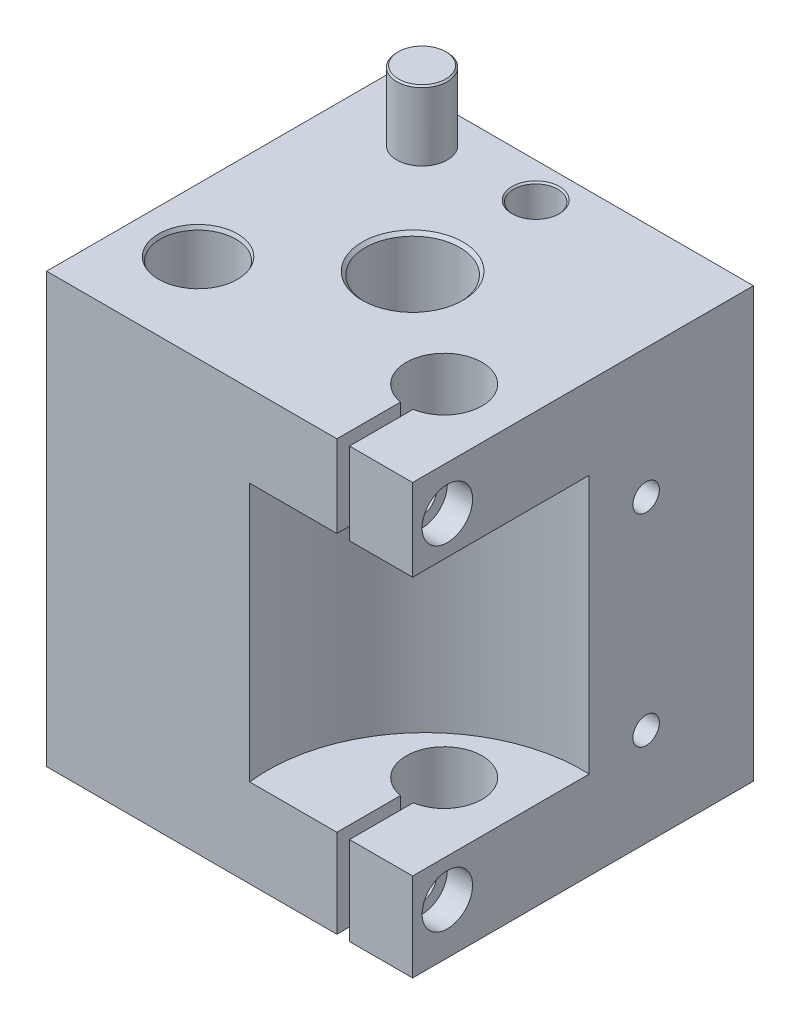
ISO-10303-21;
HEADER;
FILE_DESCRIPTION(('STEP AP214'),'2;1');
FILE_NAME('part.step','',(''),(''),'','','');
FILE_SCHEMA(('AUTOMOTIVE_DESIGN { 1 0 10303 214 1 1 1 1 }'));
ENDSEC;
DATA;
#1=APPLICATION_CONTEXT('core data for automotive mechanical design processes');
#2=APPLICATION_PROTOCOL_DEFINITION('international standard','automotive_design',2000,#1);
#3=PRODUCT_CONTEXT('',#1,'mechanical');
#4=PRODUCT('Part','Part','',(#3));
#5=PRODUCT_RELATED_PRODUCT_CATEGORY('part','',(#4));
#6=PRODUCT_DEFINITION_FORMATION('','',#4);
#7=PRODUCT_DEFINITION_CONTEXT('part definition',#1,'design');
#8=PRODUCT_DEFINITION('design','',#6,#7);
#9=PRODUCT_DEFINITION_SHAPE('','',#8);
#10=(LENGTH_UNIT() NAMED_UNIT(*) SI_UNIT(.MILLI.,.METRE.));
#11=(NAMED_UNIT(*) PLANE_ANGLE_UNIT() SI_UNIT($,.RADIAN.));
#12=(NAMED_UNIT(*) SI_UNIT($,.STERADIAN.) SOLID_ANGLE_UNIT());
#13=UNCERTAINTY_MEASURE_WITH_UNIT(LENGTH_MEASURE(1.E-05),#10,'distance_accuracy_value','');
#14=(GEOMETRIC_REPRESENTATION_CONTEXT(3) GLOBAL_UNCERTAINTY_ASSIGNED_CONTEXT((#13)) GLOBAL_UNIT_ASSIGNED_CONTEXT((#10,
#11,#12)) REPRESENTATION_CONTEXT('',''));
#15=CARTESIAN_POINT('',(0.,0.,0.));
#16=DIRECTION('',(0.,0.,1.));
#17=DIRECTION('',(1.,0.,0.));
#18=AXIS2_PLACEMENT_3D('',#15,#16,#17);
#19=CARTESIAN_POINT('',(58.,68.,0.));
#20=DIRECTION('',(-1.,0.,0.));
#21=DIRECTION('',(0.,0.,1.));
#22=AXIS2_PLACEMENT_3D('',#19,#20,#21);
#23=PLANE('',#22);
#24=CARTESIAN_POINT('',(58.,61.,-5.5));
#25=DIRECTION('',(1.,0.,0.));
#26=DIRECTION('',(0.,0.,-1.));
#27=AXIS2_PLACEMENT_3D('',#24,#25,#26);
#28=CIRCLE('',#27,4.);
#29=CARTESIAN_POINT('',(58.,61.,-9.5));
#30=VERTEX_POINT('',#29);
#31=EDGE_CURVE('E9358',#30,#30,#28,.T.);
#32=ORIENTED_EDGE('',*,*,#31,.F.);
#33=EDGE_LOOP('',(#32));
#34=FACE_BOUND('',#33,.T.);
#35=CARTESIAN_POINT('',(58.,15.5,-37.));
#36=DIRECTION('',(1.,0.,0.));
#37=DIRECTION('',(0.,0.,-1.));
#38=AXIS2_PLACEMENT_3D('',#35,#36,#37);
#39=CIRCLE('',#38,2.09999999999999);
#40=CARTESIAN_POINT('',(58.,15.5,-39.1));
#41=VERTEX_POINT('',#40);
#42=EDGE_CURVE('E9367',#41,#41,#39,.T.);
#43=ORIENTED_EDGE('',*,*,#42,.F.);
#44=EDGE_LOOP('',(#43));
#45=FACE_BOUND('',#44,.T.);
#46=CARTESIAN_POINT('',(58.,47.5,-37.));
#47=DIRECTION('',(1.,0.,0.));
#48=DIRECTION('',(0.,0.,-1.));
#49=AXIS2_PLACEMENT_3D('',#46,#47,#48);
#50=CIRCLE('',#49,2.1);
#51=CARTESIAN_POINT('',(58.,47.5,-39.1));
#52=VERTEX_POINT('',#51);
#53=EDGE_CURVE('E9373',#52,#52,#50,.T.);
#54=ORIENTED_EDGE('',*,*,#53,.F.);
#55=EDGE_LOOP('',(#54));
#56=FACE_BOUND('',#55,.T.);
#57=DIRECTION('',(0.,0.,1.));
#58=VECTOR('',#57,1.);
#59=CARTESIAN_POINT('',(58.,55.,0.));
#60=LINE('',#59,#58);
#61=CARTESIAN_POINT('',(58.,55.,-27.9799919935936));
#62=VERTEX_POINT('',#61);
#63=CARTESIAN_POINT('',(58.,55.,0.));
#64=VERTEX_POINT('',#63);
#65=EDGE_CURVE('E9455',#62,#64,#60,.T.);
#66=ORIENTED_EDGE('',*,*,#65,.F.);
#67=DIRECTION('',(0.,-1.,0.));
#68=VECTOR('',#67,1.);
#69=CARTESIAN_POINT('',(58.,55.,-27.9799919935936));
#70=LINE('',#69,#68);
#71=CARTESIAN_POINT('',(58.,14.,-27.9799919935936));
#72=VERTEX_POINT('',#71);
#73=EDGE_CURVE('E11',#62,#72,#70,.T.);
#74=ORIENTED_EDGE('',*,*,#73,.T.);
#75=DIRECTION('',(0.,0.,1.));
#76=VECTOR('',#75,1.);
#77=CARTESIAN_POINT('',(58.,14.,0.));
#78=LINE('',#77,#76);
#79=CARTESIAN_POINT('',(58.,14.,0.));
#80=VERTEX_POINT('',#79);
#81=EDGE_CURVE('E9443',#72,#80,#78,.T.);
#82=ORIENTED_EDGE('',*,*,#81,.T.);
#83=DIRECTION('',(0.,-1.,0.));
#84=VECTOR('',#83,1.);
#85=CARTESIAN_POINT('',(58.,68.,0.));
#86=LINE('',#85,#84);
#87=CARTESIAN_POINT('',(58.,0.,0.));
#88=VERTEX_POINT('',#87);
#89=EDGE_CURVE('E9550',#80,#88,#86,.T.);
#90=ORIENTED_EDGE('',*,*,#89,.T.);
#91=DIRECTION('',(0.,0.,-1.));
#92=VECTOR('',#91,1.);
#93=CARTESIAN_POINT('',(58.,0.,0.));
#94=LINE('',#93,#92);
#95=CARTESIAN_POINT('',(58.,0.,-54.));
#96=VERTEX_POINT('',#95);
#97=EDGE_CURVE('E9529',#88,#96,#94,.T.);
#98=ORIENTED_EDGE('',*,*,#97,.T.);
#99=DIRECTION('',(0.,-1.,0.));
#100=VECTOR('',#99,1.);
#101=CARTESIAN_POINT('',(58.,68.,-54.));
#102=LINE('',#101,#100);
#103=CARTESIAN_POINT('',(58.,68.,-54.));
#104=VERTEX_POINT('',#103);
#105=EDGE_CURVE('E9547',#104,#96,#102,.T.);
#106=ORIENTED_EDGE('',*,*,#105,.F.);
#107=DIRECTION('',(0.,0.,-1.));
#108=VECTOR('',#107,1.);
#109=CARTESIAN_POINT('',(58.,68.,0.));
#110=LINE('',#109,#108);
#111=CARTESIAN_POINT('',(58.,68.,0.));
#112=VERTEX_POINT('',#111);
#113=EDGE_CURVE('E9540',#112,#104,#110,.T.);
#114=ORIENTED_EDGE('',*,*,#113,.F.);
#115=EDGE_CURVE('E9551',#112,#64,#86,.T.);
#116=ORIENTED_EDGE('',*,*,#115,.T.);
#117=EDGE_LOOP('',(#66,#74,#82,#90,#98,#106,#114,#116));
#118=FACE_BOUND('',#117,.T.);
#119=CARTESIAN_POINT('',(58.,8.,-5.5));
#120=DIRECTION('',(1.,0.,0.));
#121=DIRECTION('',(0.,0.,-1.));
#122=AXIS2_PLACEMENT_3D('',#119,#120,#121);
#123=CIRCLE('',#122,3.99999999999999);
#124=CARTESIAN_POINT('',(58.,8.,-9.49999999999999));
#125=VERTEX_POINT('',#124);
#126=EDGE_CURVE('E9346',#125,#125,#123,.T.);
#127=ORIENTED_EDGE('',*,*,#126,.F.);
#128=EDGE_LOOP('',(#127));
#129=FACE_BOUND('',#128,.T.);
#130=ADVANCED_FACE('F9177',(#34,#45,#56,#118,#129),#23,.F.);
#131=CARTESIAN_POINT('',(0.,68.,0.));
#132=DIRECTION('',(0.,0.,-1.));
#133=DIRECTION('',(-1.,0.,0.));
#134=AXIS2_PLACEMENT_3D('',#131,#132,#133);
#135=PLANE('',#134);
#136=DIRECTION('',(-1.,0.,0.));
#137=VECTOR('',#136,1.);
#138=CARTESIAN_POINT('',(0.,55.,0.));
#139=LINE('',#138,#137);
#140=CARTESIAN_POINT('',(48.,55.,0.));
#141=VERTEX_POINT('',#140);
#142=EDGE_CURVE('E9451',#64,#141,#139,.T.);
#143=ORIENTED_EDGE('',*,*,#142,.F.);
#144=ORIENTED_EDGE('',*,*,#115,.F.);
#145=DIRECTION('',(1.,0.,0.));
#146=VECTOR('',#145,1.);
#147=CARTESIAN_POINT('',(0.,68.,0.));
#148=LINE('',#147,#146);
#149=CARTESIAN_POINT('',(48.,68.,0.));
#150=VERTEX_POINT('',#149);
#151=EDGE_CURVE('E9536',#150,#112,#148,.T.);
#152=ORIENTED_EDGE('',*,*,#151,.F.);
#153=DIRECTION('',(0.,1.,0.));
#154=VECTOR('',#153,1.);
#155=CARTESIAN_POINT('',(48.,70.,0.));
#156=LINE('',#155,#154);
#157=EDGE_CURVE('E9462',#141,#150,#156,.T.);
#158=ORIENTED_EDGE('',*,*,#157,.F.);
#159=EDGE_LOOP('',(#143,#144,#152,#158));
#160=FACE_BOUND('',#159,.T.);
#161=ADVANCED_FACE('F9605',(#160),#135,.F.);
#162=DIRECTION('',(-1.,0.,0.));
#163=VECTOR('',#162,1.);
#164=CARTESIAN_POINT('',(0.,55.,0.));
#165=LINE('',#164,#163);
#166=CARTESIAN_POINT('',(46.,55.,0.));
#167=VERTEX_POINT('',#166);
#168=CARTESIAN_POINT('',(32.1806527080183,55.,0.));
#169=VERTEX_POINT('',#168);
#170=EDGE_CURVE('E9457',#167,#169,#165,.T.);
#171=ORIENTED_EDGE('',*,*,#170,.F.);
#172=DIRECTION('',(0.,-1.,0.));
#173=VECTOR('',#172,1.);
#174=CARTESIAN_POINT('',(46.,70.,0.));
#175=LINE('',#174,#173);
#176=CARTESIAN_POINT('',(46.,68.,0.));
#177=VERTEX_POINT('',#176);
#178=EDGE_CURVE('E9467',#177,#167,#175,.T.);
#179=ORIENTED_EDGE('',*,*,#178,.F.);
#180=CARTESIAN_POINT('',(0.,68.,0.));
#181=VERTEX_POINT('',#180);
#182=EDGE_CURVE('E9537',#181,#177,#148,.T.);
#183=ORIENTED_EDGE('',*,*,#182,.F.);
#184=DIRECTION('',(0.,-1.,0.));
#185=VECTOR('',#184,1.);
#186=CARTESIAN_POINT('',(0.,68.,0.));
#187=LINE('',#186,#185);
#188=CARTESIAN_POINT('',(0.,0.,0.));
#189=VERTEX_POINT('',#188);
#190=EDGE_CURVE('E9554',#181,#189,#187,.T.);
#191=ORIENTED_EDGE('',*,*,#190,.T.);
#192=DIRECTION('',(1.,0.,0.));
#193=VECTOR('',#192,1.);
#194=CARTESIAN_POINT('',(0.,0.,0.));
#195=LINE('',#194,#193);
#196=CARTESIAN_POINT('',(46.,0.,0.));
#197=VERTEX_POINT('',#196);
#198=EDGE_CURVE('E9526',#189,#197,#195,.T.);
#199=ORIENTED_EDGE('',*,*,#198,.T.);
#200=CARTESIAN_POINT('',(46.,14.,0.));
#201=VERTEX_POINT('',#200);
#202=EDGE_CURVE('E9466',#201,#197,#175,.T.);
#203=ORIENTED_EDGE('',*,*,#202,.F.);
#204=DIRECTION('',(-1.,0.,0.));
#205=VECTOR('',#204,1.);
#206=CARTESIAN_POINT('',(0.,14.,0.));
#207=LINE('',#206,#205);
#208=CARTESIAN_POINT('',(32.1806527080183,14.,0.));
#209=VERTEX_POINT('',#208);
#210=EDGE_CURVE('E9446',#201,#209,#207,.T.);
#211=ORIENTED_EDGE('',*,*,#210,.T.);
#212=DIRECTION('',(0.,-1.,0.));
#213=VECTOR('',#212,1.);
#214=CARTESIAN_POINT('',(32.1806527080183,55.,0.));
#215=LINE('',#214,#213);
#216=EDGE_CURVE('E9459',#209,#169,#215,.F.);
#217=ORIENTED_EDGE('',*,*,#216,.T.);
#218=EDGE_LOOP('',(#171,#179,#183,#191,#199,#203,#211,#217));
#219=FACE_BOUND('',#218,.T.);
#220=ADVANCED_FACE('F9593',(#219),#135,.F.);
#221=CARTESIAN_POINT('',(47.,68.,-16.));
#222=DIRECTION('',(0.,1.,0.));
#223=DIRECTION('',(0.,0.,1.));
#224=AXIS2_PLACEMENT_3D('',#221,#222,#223);
#225=CYLINDRICAL_SURFACE('',#224,5.99999999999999);
#226=CARTESIAN_POINT('',(47.,55.,-16.));
#227=DIRECTION('',(0.,-1.,0.));
#228=DIRECTION('',(0.,0.,-1.));
#229=AXIS2_PLACEMENT_3D('',#226,#227,#228);
#230=CIRCLE('',#229,5.99999999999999);
#231=CARTESIAN_POINT('',(48.,55.,-10.0839202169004));
#232=VERTEX_POINT('',#231);
#233=CARTESIAN_POINT('',(46.,55.,-10.0839202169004));
#234=VERTEX_POINT('',#233);
#235=EDGE_CURVE('E9449',#232,#234,#230,.F.);
#236=ORIENTED_EDGE('',*,*,#235,.F.);
#237=DIRECTION('',(0.,1.,0.));
#238=VECTOR('',#237,1.);
#239=CARTESIAN_POINT('',(48.,68.,-10.0839202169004));
#240=LINE('',#239,#238);
#241=CARTESIAN_POINT('',(48.,68.,-10.0839202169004));
#242=VERTEX_POINT('',#241);
#243=EDGE_CURVE('E9200',#232,#242,#240,.T.);
#244=ORIENTED_EDGE('',*,*,#243,.T.);
#245=CARTESIAN_POINT('',(47.,68.,-16.));
#246=DIRECTION('',(0.,1.,0.));
#247=DIRECTION('',(0.,0.,1.));
#248=AXIS2_PLACEMENT_3D('',#245,#246,#247);
#249=CIRCLE('',#248,5.99999999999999);
#250=CARTESIAN_POINT('',(46.,68.,-10.0839202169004));
#251=VERTEX_POINT('',#250);
#252=EDGE_CURVE('E9484',#242,#251,#249,.T.);
#253=ORIENTED_EDGE('',*,*,#252,.T.);
#254=DIRECTION('',(0.,1.,0.));
#255=VECTOR('',#254,1.);
#256=CARTESIAN_POINT('',(46.,68.,-10.0839202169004));
#257=LINE('',#256,#255);
#258=EDGE_CURVE('E9567',#251,#234,#257,.F.);
#259=ORIENTED_EDGE('',*,*,#258,.T.);
#260=EDGE_LOOP('',(#236,#244,#253,#259));
#261=FACE_BOUND('',#260,.T.);
#262=ADVANCED_FACE('F9581',(#261),#225,.F.);
#263=CARTESIAN_POINT('',(46.,70.,-16.));
#264=DIRECTION('',(-1.,0.,0.));
#265=DIRECTION('',(0.,-1.,0.));
#266=AXIS2_PLACEMENT_3D('',#263,#264,#265);
#267=PLANE('',#266);
#268=CARTESIAN_POINT('',(46.,61.,-5.5));
#269=DIRECTION('',(1.,0.,0.));
#270=DIRECTION('',(0.,0.,-1.));
#271=AXIS2_PLACEMENT_3D('',#268,#269,#270);
#272=CIRCLE('',#271,1.64999999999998);
#273=CARTESIAN_POINT('',(46.,61.,-7.14999999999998));
#274=VERTEX_POINT('',#273);
#275=EDGE_CURVE('E9332',#274,#274,#272,.T.);
#276=ORIENTED_EDGE('',*,*,#275,.F.);
#277=EDGE_LOOP('',(#276));
#278=FACE_BOUND('',#277,.T.);
#279=DIRECTION('',(0.,0.,1.));
#280=VECTOR('',#279,1.);
#281=CARTESIAN_POINT('',(46.,55.,-16.));
#282=LINE('',#281,#280);
#283=EDGE_CURVE('E9453',#234,#167,#282,.T.);
#284=ORIENTED_EDGE('',*,*,#283,.F.);
#285=ORIENTED_EDGE('',*,*,#258,.F.);
#286=DIRECTION('',(0.,0.,-1.));
#287=VECTOR('',#286,1.);
#288=CARTESIAN_POINT('',(46.,68.,-54.));
#289=LINE('',#288,#287);
#290=EDGE_CURVE('E9470',#177,#251,#289,.T.);
#291=ORIENTED_EDGE('',*,*,#290,.F.);
#292=ORIENTED_EDGE('',*,*,#178,.T.);
#293=EDGE_LOOP('',(#284,#285,#291,#292));
#294=FACE_BOUND('',#293,.T.);
#295=ADVANCED_FACE('F9590',(#278,#294),#267,.F.);
#296=CARTESIAN_POINT('',(48.,70.,-16.));
#297=DIRECTION('',(1.,0.,0.));
#298=DIRECTION('',(0.,1.,0.));
#299=AXIS2_PLACEMENT_3D('',#296,#297,#298);
#300=PLANE('',#299);
#301=CARTESIAN_POINT('',(48.,61.,-5.5));
#302=DIRECTION('',(1.,0.,0.));
#303=DIRECTION('',(0.,1.,0.));
#304=AXIS2_PLACEMENT_3D('',#301,#302,#303);
#305=CIRCLE('',#304,2.25);
#306=CARTESIAN_POINT('',(48.,63.25,-5.5));
#307=VERTEX_POINT('',#306);
#308=EDGE_CURVE('E9361',#307,#307,#305,.T.);
#309=ORIENTED_EDGE('',*,*,#308,.T.);
#310=EDGE_LOOP('',(#309));
#311=FACE_BOUND('',#310,.T.);
#312=DIRECTION('',(0.,0.,-1.));
#313=VECTOR('',#312,1.);
#314=CARTESIAN_POINT('',(48.,55.,-16.));
#315=LINE('',#314,#313);
#316=EDGE_CURVE('E9185',#141,#232,#315,.T.);
#317=ORIENTED_EDGE('',*,*,#316,.F.);
#318=ORIENTED_EDGE('',*,*,#157,.T.);
#319=DIRECTION('',(0.,0.,1.));
#320=VECTOR('',#319,1.);
#321=CARTESIAN_POINT('',(48.,68.,-54.));
#322=LINE('',#321,#320);
#323=EDGE_CURVE('E9476',#242,#150,#322,.T.);
#324=ORIENTED_EDGE('',*,*,#323,.F.);
#325=ORIENTED_EDGE('',*,*,#243,.F.);
#326=EDGE_LOOP('',(#317,#318,#324,#325));
#327=FACE_BOUND('',#326,.T.);
#328=ADVANCED_FACE('F9582',(#311,#327),#300,.F.);
#329=ORIENTED_EDGE('',*,*,#89,.F.);
#330=DIRECTION('',(-1.,0.,0.));
#331=VECTOR('',#330,1.);
#332=CARTESIAN_POINT('',(0.,14.,0.));
#333=LINE('',#332,#331);
#334=CARTESIAN_POINT('',(48.,14.,0.));
#335=VERTEX_POINT('',#334);
#336=EDGE_CURVE('E9437',#80,#335,#333,.T.);
#337=ORIENTED_EDGE('',*,*,#336,.T.);
#338=CARTESIAN_POINT('',(48.,0.,0.));
#339=VERTEX_POINT('',#338);
#340=EDGE_CURVE('E9463',#339,#335,#156,.T.);
#341=ORIENTED_EDGE('',*,*,#340,.F.);
#342=EDGE_CURVE('E9525',#339,#88,#195,.T.);
#343=ORIENTED_EDGE('',*,*,#342,.T.);
#344=EDGE_LOOP('',(#329,#337,#341,#343));
#345=FACE_BOUND('',#344,.T.);
#346=ADVANCED_FACE('F9636',(#345),#135,.F.);
#347=CARTESIAN_POINT('',(0.,0.,-54.));
#348=DIRECTION('',(0.,-1.,0.));
#349=DIRECTION('',(0.,0.,-1.));
#350=AXIS2_PLACEMENT_3D('',#347,#348,#349);
#351=PLANE('',#350);
#352=DIRECTION('',(0.,0.,1.));
#353=VECTOR('',#352,1.);
#354=CARTESIAN_POINT('',(48.,0.,-54.));
#355=LINE('',#354,#353);
#356=CARTESIAN_POINT('',(48.,0.,-10.0839202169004));
#357=VERTEX_POINT('',#356);
#358=EDGE_CURVE('E9479',#357,#339,#355,.T.);
#359=ORIENTED_EDGE('',*,*,#358,.F.);
#360=CARTESIAN_POINT('',(47.,0.,-16.));
#361=DIRECTION('',(0.,1.,0.));
#362=DIRECTION('',(0.,0.,1.));
#363=AXIS2_PLACEMENT_3D('',#360,#361,#362);
#364=CIRCLE('',#363,5.99999999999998);
#365=CARTESIAN_POINT('',(46.,0.,-10.0839202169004));
#366=VERTEX_POINT('',#365);
#367=EDGE_CURVE('E9481',#357,#366,#364,.T.);
#368=ORIENTED_EDGE('',*,*,#367,.T.);
#369=DIRECTION('',(0.,0.,-1.));
#370=VECTOR('',#369,1.);
#371=CARTESIAN_POINT('',(46.,0.,-54.));
#372=LINE('',#371,#370);
#373=EDGE_CURVE('E9473',#197,#366,#372,.T.);
#374=ORIENTED_EDGE('',*,*,#373,.F.);
#375=ORIENTED_EDGE('',*,*,#198,.F.);
#376=DIRECTION('',(0.,0.,1.));
#377=VECTOR('',#376,1.);
#378=CARTESIAN_POINT('',(0.,0.,0.));
#379=LINE('',#378,#377);
#380=CARTESIAN_POINT('',(0.,0.,-54.));
#381=VERTEX_POINT('',#380);
#382=EDGE_CURVE('E9522',#381,#189,#379,.T.);
#383=ORIENTED_EDGE('',*,*,#382,.F.);
#384=DIRECTION('',(-1.,0.,0.));
#385=VECTOR('',#384,1.);
#386=CARTESIAN_POINT('',(0.,0.,-54.));
#387=LINE('',#386,#385);
#388=EDGE_CURVE('E9531',#96,#381,#387,.T.);
#389=ORIENTED_EDGE('',*,*,#388,.F.);
#390=ORIENTED_EDGE('',*,*,#97,.F.);
#391=ORIENTED_EDGE('',*,*,#342,.F.);
#392=EDGE_LOOP('',(#359,#368,#374,#375,#383,#389,#390,#391));
#393=FACE_BOUND('',#392,.T.);
#394=CARTESIAN_POINT('',(29.,0.,-48.5));
#395=DIRECTION('',(0.,1.,0.));
#396=DIRECTION('',(0.,0.,1.));
#397=AXIS2_PLACEMENT_3D('',#394,#395,#396);
#398=CIRCLE('',#397,3.74999999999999);
#399=CARTESIAN_POINT('',(29.,0.,-44.75));
#400=VERTEX_POINT('',#399);
#401=EDGE_CURVE('E9486',#400,#400,#398,.T.);
#402=ORIENTED_EDGE('',*,*,#401,.T.);
#403=EDGE_LOOP('',(#402));
#404=FACE_BOUND('',#403,.T.);
#405=CARTESIAN_POINT('',(29.,0.,-29.));
#406=DIRECTION('',(0.,1.,0.));
#407=DIRECTION('',(0.,0.,1.));
#408=AXIS2_PLACEMENT_3D('',#405,#406,#407);
#409=CIRCLE('',#408,7.99999999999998);
#410=CARTESIAN_POINT('',(29.,0.,-21.));
#411=VERTEX_POINT('',#410);
#412=EDGE_CURVE('E9510',#411,#411,#409,.T.);
#413=ORIENTED_EDGE('',*,*,#412,.T.);
#414=EDGE_LOOP('',(#413));
#415=FACE_BOUND('',#414,.T.);
#416=CARTESIAN_POINT('',(10.,0.,-14.));
#417=DIRECTION('',(0.,1.,0.));
#418=DIRECTION('',(0.,0.,1.));
#419=AXIS2_PLACEMENT_3D('',#416,#417,#418);
#420=CIRCLE('',#419,6.24999999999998);
#421=CARTESIAN_POINT('',(10.,0.,-7.75000000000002));
#422=VERTEX_POINT('',#421);
#423=EDGE_CURVE('E9498',#422,#422,#420,.T.);
#424=ORIENTED_EDGE('',*,*,#423,.T.);
#425=EDGE_LOOP('',(#424));
#426=FACE_BOUND('',#425,.T.);
#427=ADVANCED_FACE('F9621',(#393,#404,#415,#426),#351,.T.);
#428=CARTESIAN_POINT('',(0.,68.,-54.));
#429=DIRECTION('',(0.,-1.,0.));
#430=DIRECTION('',(0.,0.,-1.));
#431=AXIS2_PLACEMENT_3D('',#428,#429,#430);
#432=PLANE('',#431);
#433=ORIENTED_EDGE('',*,*,#252,.F.);
#434=ORIENTED_EDGE('',*,*,#323,.T.);
#435=ORIENTED_EDGE('',*,*,#151,.T.);
#436=ORIENTED_EDGE('',*,*,#113,.T.);
#437=DIRECTION('',(-1.,0.,0.));
#438=VECTOR('',#437,1.);
#439=CARTESIAN_POINT('',(0.,68.,-54.));
#440=LINE('',#439,#438);
#441=CARTESIAN_POINT('',(0.,68.,-54.));
#442=VERTEX_POINT('',#441);
#443=EDGE_CURVE('E9542',#104,#442,#440,.T.);
#444=ORIENTED_EDGE('',*,*,#443,.T.);
#445=DIRECTION('',(0.,0.,1.));
#446=VECTOR('',#445,1.);
#447=CARTESIAN_POINT('',(0.,68.,0.));
#448=LINE('',#447,#446);
#449=EDGE_CURVE('E9533',#442,#181,#448,.T.);
#450=ORIENTED_EDGE('',*,*,#449,.T.);
#451=ORIENTED_EDGE('',*,*,#182,.T.);
#452=ORIENTED_EDGE('',*,*,#290,.T.);
#453=EDGE_LOOP('',(#433,#434,#435,#436,#444,#450,#451,#452));
#454=FACE_BOUND('',#453,.T.);
#455=CARTESIAN_POINT('',(29.,68.,-29.));
#456=DIRECTION('',(0.,1.,0.));
#457=DIRECTION('',(0.,0.,1.));
#458=AXIS2_PLACEMENT_3D('',#455,#456,#457);
#459=CIRCLE('',#458,8.);
#460=CARTESIAN_POINT('',(29.,68.,-21.));
#461=VERTEX_POINT('',#460);
#462=EDGE_CURVE('E9519',#461,#461,#459,.T.);
#463=ORIENTED_EDGE('',*,*,#462,.F.);
#464=EDGE_LOOP('',(#463));
#465=FACE_BOUND('',#464,.T.);
#466=CARTESIAN_POINT('',(10.,68.,-14.));
#467=DIRECTION('',(0.,1.,0.));
#468=DIRECTION('',(0.,0.,1.));
#469=AXIS2_PLACEMENT_3D('',#466,#467,#468);
#470=CIRCLE('',#469,6.25);
#471=CARTESIAN_POINT('',(10.,68.,-7.75));
#472=VERTEX_POINT('',#471);
#473=EDGE_CURVE('E9507',#472,#472,#470,.T.);
#474=ORIENTED_EDGE('',*,*,#473,.F.);
#475=EDGE_LOOP('',(#474));
#476=FACE_BOUND('',#475,.T.);
#477=CARTESIAN_POINT('',(29.,68.,-48.5));
#478=DIRECTION('',(0.,1.,0.));
#479=DIRECTION('',(0.,0.,1.));
#480=AXIS2_PLACEMENT_3D('',#477,#478,#479);
#481=CIRCLE('',#480,3.75);
#482=CARTESIAN_POINT('',(29.,68.,-44.75));
#483=VERTEX_POINT('',#482);
#484=EDGE_CURVE('E9495',#483,#483,#481,.T.);
#485=ORIENTED_EDGE('',*,*,#484,.F.);
#486=EDGE_LOOP('',(#485));
#487=FACE_BOUND('',#486,.T.);
#488=CARTESIAN_POINT('',(12.5,68.,-47.));
#489=DIRECTION('',(0.,-1.,0.));
#490=DIRECTION('',(0.,0.,-1.));
#491=AXIS2_PLACEMENT_3D('',#488,#489,#490);
#492=CIRCLE('',#491,4.);
#493=CARTESIAN_POINT('',(12.5,68.,-51.));
#494=VERTEX_POINT('',#493);
#495=EDGE_CURVE('E9557',#494,#494,#492,.F.);
#496=ORIENTED_EDGE('',*,*,#495,.F.);
#497=EDGE_LOOP('',(#496));
#498=FACE_BOUND('',#497,.T.);
#499=ADVANCED_FACE('F9586',(#454,#465,#476,#487,#498),#432,.F.);
#500=CARTESIAN_POINT('',(0.,68.,0.));
#501=DIRECTION('',(1.,0.,0.));
#502=DIRECTION('',(0.,0.,-1.));
#503=AXIS2_PLACEMENT_3D('',#500,#501,#502);
#504=PLANE('',#503);
#505=CARTESIAN_POINT('',(0.,15.5,-37.));
#506=DIRECTION('',(-1.,0.,0.));
#507=DIRECTION('',(0.,0.,1.));
#508=AXIS2_PLACEMENT_3D('',#505,#506,#507);
#509=CIRCLE('',#508,2.09999999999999);
#510=CARTESIAN_POINT('',(0.,15.5,-34.9));
#511=VERTEX_POINT('',#510);
#512=EDGE_CURVE('E9421',#511,#511,#509,.T.);
#513=ORIENTED_EDGE('',*,*,#512,.F.);
#514=EDGE_LOOP('',(#513));
#515=FACE_BOUND('',#514,.T.);
#516=CARTESIAN_POINT('',(0.,47.5,-37.));
#517=DIRECTION('',(-1.,0.,0.));
#518=DIRECTION('',(0.,0.,1.));
#519=AXIS2_PLACEMENT_3D('',#516,#517,#518);
#520=CIRCLE('',#519,2.09999999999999);
#521=CARTESIAN_POINT('',(0.,47.5,-34.9));
#522=VERTEX_POINT('',#521);
#523=EDGE_CURVE('E9427',#522,#522,#520,.T.);
#524=ORIENTED_EDGE('',*,*,#523,.F.);
#525=EDGE_LOOP('',(#524));
#526=FACE_BOUND('',#525,.T.);
#527=ORIENTED_EDGE('',*,*,#382,.T.);
#528=ORIENTED_EDGE('',*,*,#190,.F.);
#529=ORIENTED_EDGE('',*,*,#449,.F.);
#530=DIRECTION('',(0.,-1.,0.));
#531=VECTOR('',#530,1.);
#532=CARTESIAN_POINT('',(0.,68.,-54.));
#533=LINE('',#532,#531);
#534=EDGE_CURVE('E9544',#442,#381,#533,.T.);
#535=ORIENTED_EDGE('',*,*,#534,.T.);
#536=EDGE_LOOP('',(#527,#528,#529,#535));
#537=FACE_BOUND('',#536,.T.);
#538=ADVANCED_FACE('F9179',(#515,#526,#537),#504,.F.);
#539=CARTESIAN_POINT('',(0.,68.,-54.));
#540=DIRECTION('',(0.,0.,1.));
#541=DIRECTION('',(1.,0.,0.));
#542=AXIS2_PLACEMENT_3D('',#539,#540,#541);
#543=PLANE('',#542);
#544=CARTESIAN_POINT('',(52.,46.,-54.));
#545=DIRECTION('',(0.,0.,-1.));
#546=DIRECTION('',(-1.,0.,0.));
#547=AXIS2_PLACEMENT_3D('',#544,#545,#546);
#548=CIRCLE('',#547,2.625);
#549=CARTESIAN_POINT('',(49.375,46.,-54.));
#550=VERTEX_POINT('',#549);
#551=EDGE_CURVE('E9382',#550,#550,#548,.T.);
#552=ORIENTED_EDGE('',*,*,#551,.F.);
#553=EDGE_LOOP('',(#552));
#554=FACE_BOUND('',#553,.T.);
#555=CARTESIAN_POINT('',(6.,46.,-54.));
#556=DIRECTION('',(0.,0.,-1.));
#557=DIRECTION('',(-1.,0.,0.));
#558=AXIS2_PLACEMENT_3D('',#555,#556,#557);
#559=CIRCLE('',#558,2.625);
#560=CARTESIAN_POINT('',(3.375,46.,-54.));
#561=VERTEX_POINT('',#560);
#562=EDGE_CURVE('E9391',#561,#561,#559,.T.);
#563=ORIENTED_EDGE('',*,*,#562,.F.);
#564=EDGE_LOOP('',(#563));
#565=FACE_BOUND('',#564,.T.);
#566=CARTESIAN_POINT('',(52.,31.,-54.));
#567=DIRECTION('',(0.,0.,-1.));
#568=DIRECTION('',(-1.,0.,0.));
#569=AXIS2_PLACEMENT_3D('',#566,#567,#568);
#570=CIRCLE('',#569,2.5);
#571=CARTESIAN_POINT('',(49.5,31.,-54.));
#572=VERTEX_POINT('',#571);
#573=EDGE_CURVE('E9397',#572,#572,#570,.T.);
#574=ORIENTED_EDGE('',*,*,#573,.F.);
#575=EDGE_LOOP('',(#574));
#576=FACE_BOUND('',#575,.T.);
#577=CARTESIAN_POINT('',(52.,61.,-54.));
#578=DIRECTION('',(0.,0.,-1.));
#579=DIRECTION('',(-1.,0.,0.));
#580=AXIS2_PLACEMENT_3D('',#577,#578,#579);
#581=CIRCLE('',#580,2.5);
#582=CARTESIAN_POINT('',(49.5,61.,-54.));
#583=VERTEX_POINT('',#582);
#584=EDGE_CURVE('E9403',#583,#583,#581,.T.);
#585=ORIENTED_EDGE('',*,*,#584,.F.);
#586=EDGE_LOOP('',(#585));
#587=FACE_BOUND('',#586,.T.);
#588=CARTESIAN_POINT('',(6.,31.,-54.));
#589=DIRECTION('',(0.,0.,-1.));
#590=DIRECTION('',(-1.,0.,0.));
#591=AXIS2_PLACEMENT_3D('',#588,#589,#590);
#592=CIRCLE('',#591,2.5);
#593=CARTESIAN_POINT('',(3.5,31.,-54.));
#594=VERTEX_POINT('',#593);
#595=EDGE_CURVE('E9409',#594,#594,#592,.T.);
#596=ORIENTED_EDGE('',*,*,#595,.F.);
#597=EDGE_LOOP('',(#596));
#598=FACE_BOUND('',#597,.T.);
#599=CARTESIAN_POINT('',(6.,61.,-54.));
#600=DIRECTION('',(0.,0.,-1.));
#601=DIRECTION('',(-1.,0.,0.));
#602=AXIS2_PLACEMENT_3D('',#599,#600,#601);
#603=CIRCLE('',#602,2.5);
#604=CARTESIAN_POINT('',(3.5,61.,-54.));
#605=VERTEX_POINT('',#604);
#606=EDGE_CURVE('E9415',#605,#605,#603,.T.);
#607=ORIENTED_EDGE('',*,*,#606,.F.);
#608=EDGE_LOOP('',(#607));
#609=FACE_BOUND('',#608,.T.);
#610=ORIENTED_EDGE('',*,*,#388,.T.);
#611=ORIENTED_EDGE('',*,*,#534,.F.);
#612=ORIENTED_EDGE('',*,*,#443,.F.);
#613=ORIENTED_EDGE('',*,*,#105,.T.);
#614=EDGE_LOOP('',(#610,#611,#612,#613));
#615=FACE_BOUND('',#614,.T.);
#616=ADVANCED_FACE('F9612',(#554,#565,#576,#587,#598,#609,#615),#543,.F.);
#617=CARTESIAN_POINT('',(29.,68.,-29.));
#618=DIRECTION('',(0.,1.,0.));
#619=DIRECTION('',(0.,0.,1.));
#620=AXIS2_PLACEMENT_3D('',#617,#618,#619);
#621=CONICAL_SURFACE('',#620,8.,0.785398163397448);
#622=CARTESIAN_POINT('',(29.,67.5,-29.));
#623=DIRECTION('',(0.,1.,0.));
#624=DIRECTION('',(0.,0.,1.));
#625=AXIS2_PLACEMENT_3D('',#622,#623,#624);
#626=CIRCLE('',#625,7.49999999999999);
#627=CARTESIAN_POINT('',(29.,67.5,-21.5));
#628=VERTEX_POINT('',#627);
#629=EDGE_CURVE('E9516',#628,#628,#626,.T.);
#630=ORIENTED_EDGE('',*,*,#629,.F.);
#631=EDGE_LOOP('',(#630));
#632=FACE_BOUND('',#631,.T.);
#633=ORIENTED_EDGE('',*,*,#462,.T.);
#634=EDGE_LOOP('',(#633));
#635=FACE_BOUND('',#634,.T.);
#636=ADVANCED_FACE('F9661',(#632,#635),#621,.F.);
#637=CARTESIAN_POINT('',(29.,68.,-29.));
#638=DIRECTION('',(0.,1.,0.));
#639=DIRECTION('',(0.,0.,1.));
#640=AXIS2_PLACEMENT_3D('',#637,#638,#639);
#641=CYLINDRICAL_SURFACE('',#640,7.49999999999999);
#642=CARTESIAN_POINT('',(29.,0.5,-29.));
#643=DIRECTION('',(0.,1.,0.));
#644=DIRECTION('',(0.,0.,1.));
#645=AXIS2_PLACEMENT_3D('',#642,#643,#644);
#646=CIRCLE('',#645,7.49999999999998);
#647=CARTESIAN_POINT('',(29.,0.5,-21.5));
#648=VERTEX_POINT('',#647);
#649=EDGE_CURVE('E9513',#648,#648,#646,.T.);
#650=ORIENTED_EDGE('',*,*,#649,.F.);
#651=EDGE_LOOP('',(#650));
#652=FACE_BOUND('',#651,.T.);
#653=ORIENTED_EDGE('',*,*,#629,.T.);
#654=EDGE_LOOP('',(#653));
#655=FACE_BOUND('',#654,.T.);
#656=ADVANCED_FACE('F9667',(#652,#655),#641,.F.);
#657=CARTESIAN_POINT('',(29.,0.5,-29.));
#658=DIRECTION('',(0.,-1.,0.));
#659=DIRECTION('',(0.,0.,-1.));
#660=AXIS2_PLACEMENT_3D('',#657,#658,#659);
#661=CONICAL_SURFACE('',#660,7.49999999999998,0.785398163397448);
#662=ORIENTED_EDGE('',*,*,#412,.F.);
#663=EDGE_LOOP('',(#662));
#664=FACE_BOUND('',#663,.T.);
#665=ORIENTED_EDGE('',*,*,#649,.T.);
#666=EDGE_LOOP('',(#665));
#667=FACE_BOUND('',#666,.T.);
#668=ADVANCED_FACE('F9671',(#664,#667),#661,.F.);
#669=CARTESIAN_POINT('',(10.,68.,-14.));
#670=DIRECTION('',(0.,1.,0.));
#671=DIRECTION('',(0.,0.,1.));
#672=AXIS2_PLACEMENT_3D('',#669,#670,#671);
#673=CONICAL_SURFACE('',#672,6.25,0.392699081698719);
#674=CARTESIAN_POINT('',(10.,67.3964466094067,-14.));
#675=DIRECTION('',(0.,1.,0.));
#676=DIRECTION('',(0.,0.,1.));
#677=AXIS2_PLACEMENT_3D('',#674,#675,#676);
#678=CIRCLE('',#677,5.99999999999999);
#679=CARTESIAN_POINT('',(10.,67.3964466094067,-8.00000000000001));
#680=VERTEX_POINT('',#679);
#681=EDGE_CURVE('E9504',#680,#680,#678,.T.);
#682=ORIENTED_EDGE('',*,*,#681,.F.);
#683=EDGE_LOOP('',(#682));
#684=FACE_BOUND('',#683,.T.);
#685=ORIENTED_EDGE('',*,*,#473,.T.);
#686=EDGE_LOOP('',(#685));
#687=FACE_BOUND('',#686,.T.);
#688=ADVANCED_FACE('F9675',(#684,#687),#673,.F.);
#689=CARTESIAN_POINT('',(10.,68.,-14.));
#690=DIRECTION('',(0.,1.,0.));
#691=DIRECTION('',(0.,0.,1.));
#692=AXIS2_PLACEMENT_3D('',#689,#690,#691);
#693=CYLINDRICAL_SURFACE('',#692,5.99999999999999);
#694=CARTESIAN_POINT('',(10.,0.603553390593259,-14.));
#695=DIRECTION('',(0.,1.,0.));
#696=DIRECTION('',(0.,0.,1.));
#697=AXIS2_PLACEMENT_3D('',#694,#695,#696);
#698=CIRCLE('',#697,5.99999999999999);
#699=CARTESIAN_POINT('',(10.,0.603553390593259,-8.00000000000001));
#700=VERTEX_POINT('',#699);
#701=EDGE_CURVE('E9501',#700,#700,#698,.T.);
#702=ORIENTED_EDGE('',*,*,#701,.F.);
#703=EDGE_LOOP('',(#702));
#704=FACE_BOUND('',#703,.T.);
#705=ORIENTED_EDGE('',*,*,#681,.T.);
#706=EDGE_LOOP('',(#705));
#707=FACE_BOUND('',#706,.T.);
#708=ADVANCED_FACE('F9679',(#704,#707),#693,.F.);
#709=CARTESIAN_POINT('',(10.,0.603553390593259,-14.));
#710=DIRECTION('',(0.,-1.,0.));
#711=DIRECTION('',(0.,0.,-1.));
#712=AXIS2_PLACEMENT_3D('',#709,#710,#711);
#713=CONICAL_SURFACE('',#712,5.99999999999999,0.392699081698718);
#714=ORIENTED_EDGE('',*,*,#423,.F.);
#715=EDGE_LOOP('',(#714));
#716=FACE_BOUND('',#715,.T.);
#717=ORIENTED_EDGE('',*,*,#701,.T.);
#718=EDGE_LOOP('',(#717));
#719=FACE_BOUND('',#718,.T.);
#720=ADVANCED_FACE('F9683',(#716,#719),#713,.F.);
#721=CARTESIAN_POINT('',(29.,68.,-48.5));
#722=DIRECTION('',(0.,1.,0.));
#723=DIRECTION('',(0.,0.,1.));
#724=AXIS2_PLACEMENT_3D('',#721,#722,#723);
#725=CONICAL_SURFACE('',#724,3.75,0.785398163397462);
#726=CARTESIAN_POINT('',(29.,67.75,-48.5));
#727=DIRECTION('',(0.,1.,0.));
#728=DIRECTION('',(0.,0.,1.));
#729=AXIS2_PLACEMENT_3D('',#726,#727,#728);
#730=CIRCLE('',#729,3.49999999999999);
#731=CARTESIAN_POINT('',(29.,67.75,-45.));
#732=VERTEX_POINT('',#731);
#733=EDGE_CURVE('E9492',#732,#732,#730,.T.);
#734=ORIENTED_EDGE('',*,*,#733,.F.);
#735=EDGE_LOOP('',(#734));
#736=FACE_BOUND('',#735,.T.);
#737=ORIENTED_EDGE('',*,*,#484,.T.);
#738=EDGE_LOOP('',(#737));
#739=FACE_BOUND('',#738,.T.);
#740=ADVANCED_FACE('F9687',(#736,#739),#725,.F.);
#741=CARTESIAN_POINT('',(29.,68.,-48.5));
#742=DIRECTION('',(0.,1.,0.));
#743=DIRECTION('',(0.,0.,1.));
#744=AXIS2_PLACEMENT_3D('',#741,#742,#743);
#745=CYLINDRICAL_SURFACE('',#744,3.49999999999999);
#746=CARTESIAN_POINT('',(29.,0.25,-48.5));
#747=DIRECTION('',(0.,1.,0.));
#748=DIRECTION('',(0.,0.,1.));
#749=AXIS2_PLACEMENT_3D('',#746,#747,#748);
#750=CIRCLE('',#749,3.49999999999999);
#751=CARTESIAN_POINT('',(29.,0.25,-45.));
#752=VERTEX_POINT('',#751);
#753=EDGE_CURVE('E9489',#752,#752,#750,.T.);
#754=ORIENTED_EDGE('',*,*,#753,.F.);
#755=EDGE_LOOP('',(#754));
#756=FACE_BOUND('',#755,.T.);
#757=ORIENTED_EDGE('',*,*,#733,.T.);
#758=EDGE_LOOP('',(#757));
#759=FACE_BOUND('',#758,.T.);
#760=ADVANCED_FACE('F9691',(#756,#759),#745,.F.);
#761=CARTESIAN_POINT('',(29.,0.25,-48.5));
#762=DIRECTION('',(0.,-1.,0.));
#763=DIRECTION('',(0.,0.,-1.));
#764=AXIS2_PLACEMENT_3D('',#761,#762,#763);
#765=CONICAL_SURFACE('',#764,3.49999999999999,0.785398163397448);
#766=ORIENTED_EDGE('',*,*,#401,.F.);
#767=EDGE_LOOP('',(#766));
#768=FACE_BOUND('',#767,.T.);
#769=ORIENTED_EDGE('',*,*,#753,.T.);
#770=EDGE_LOOP('',(#769));
#771=FACE_BOUND('',#770,.T.);
#772=ADVANCED_FACE('F9695',(#768,#771),#765,.F.);
#773=CARTESIAN_POINT('',(12.5,79.,-47.));
#774=DIRECTION('',(0.,-1.,0.));
#775=DIRECTION('',(0.,0.,-1.));
#776=AXIS2_PLACEMENT_3D('',#773,#774,#775);
#777=CYLINDRICAL_SURFACE('',#776,4.);
#778=CARTESIAN_POINT('',(12.5,78.75,-47.));
#779=DIRECTION('',(0.,1.,0.));
#780=DIRECTION('',(0.,0.,1.));
#781=AXIS2_PLACEMENT_3D('',#778,#779,#780);
#782=CIRCLE('',#781,4.);
#783=CARTESIAN_POINT('',(12.5,78.75,-43.));
#784=VERTEX_POINT('',#783);
#785=EDGE_CURVE('E9563',#784,#784,#782,.F.);
#786=ORIENTED_EDGE('',*,*,#785,.T.);
#787=EDGE_LOOP('',(#786));
#788=FACE_BOUND('',#787,.T.);
#789=ORIENTED_EDGE('',*,*,#495,.T.);
#790=EDGE_LOOP('',(#789));
#791=FACE_BOUND('',#790,.T.);
#792=ADVANCED_FACE('F9699',(#788,#791),#777,.T.);
#793=CARTESIAN_POINT('',(12.5,79.,-47.));
#794=DIRECTION('',(0.,1.,0.));
#795=DIRECTION('',(0.,0.,1.));
#796=AXIS2_PLACEMENT_3D('',#793,#794,#795);
#797=PLANE('',#796);
#798=CARTESIAN_POINT('',(12.5,79.,-47.));
#799=DIRECTION('',(0.,1.,0.));
#800=DIRECTION('',(0.,0.,1.));
#801=AXIS2_PLACEMENT_3D('',#798,#799,#800);
#802=CIRCLE('',#801,3.75);
#803=CARTESIAN_POINT('',(12.5,79.,-43.25));
#804=VERTEX_POINT('',#803);
#805=EDGE_CURVE('E9560',#804,#804,#802,.T.);
#806=ORIENTED_EDGE('',*,*,#805,.T.);
#807=EDGE_LOOP('',(#806));
#808=FACE_BOUND('',#807,.T.);
#809=ADVANCED_FACE('F9703',(#808),#797,.T.);
#810=CARTESIAN_POINT('',(12.5,79.,-47.));
#811=DIRECTION('',(0.,-1.,0.));
#812=DIRECTION('',(0.,0.,-1.));
#813=AXIS2_PLACEMENT_3D('',#810,#811,#812);
#814=CONICAL_SURFACE('',#813,3.75,0.785398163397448);
#815=ORIENTED_EDGE('',*,*,#785,.F.);
#816=EDGE_LOOP('',(#815));
#817=FACE_BOUND('',#816,.T.);
#818=ORIENTED_EDGE('',*,*,#805,.F.);
#819=EDGE_LOOP('',(#818));
#820=FACE_BOUND('',#819,.T.);
#821=ADVANCED_FACE('F9707',(#817,#820),#814,.T.);
#822=CARTESIAN_POINT('',(48.,14.,-10.0839202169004));
#823=VERTEX_POINT('',#822);
#824=EDGE_CURVE('E9570',#357,#823,#240,.T.);
#825=ORIENTED_EDGE('',*,*,#824,.T.);
#826=CARTESIAN_POINT('',(47.,14.,-16.));
#827=DIRECTION('',(0.,-1.,0.));
#828=DIRECTION('',(0.,0.,-1.));
#829=AXIS2_PLACEMENT_3D('',#826,#827,#828);
#830=CIRCLE('',#829,5.99999999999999);
#831=CARTESIAN_POINT('',(46.,14.,-10.0839202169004));
#832=VERTEX_POINT('',#831);
#833=EDGE_CURVE('E9192',#823,#832,#830,.F.);
#834=ORIENTED_EDGE('',*,*,#833,.T.);
#835=EDGE_CURVE('E9566',#832,#366,#257,.F.);
#836=ORIENTED_EDGE('',*,*,#835,.T.);
#837=ORIENTED_EDGE('',*,*,#367,.F.);
#838=EDGE_LOOP('',(#825,#834,#836,#837));
#839=FACE_BOUND('',#838,.T.);
#840=ADVANCED_FACE('F9629',(#839),#225,.F.);
#841=CARTESIAN_POINT('',(46.,8.,-5.5));
#842=DIRECTION('',(1.,0.,0.));
#843=DIRECTION('',(0.,0.,-1.));
#844=AXIS2_PLACEMENT_3D('',#841,#842,#843);
#845=CIRCLE('',#844,1.64999999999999);
#846=CARTESIAN_POINT('',(46.,8.,-7.14999999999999));
#847=VERTEX_POINT('',#846);
#848=EDGE_CURVE('E9329',#847,#847,#845,.T.);
#849=ORIENTED_EDGE('',*,*,#848,.F.);
#850=EDGE_LOOP('',(#849));
#851=FACE_BOUND('',#850,.T.);
#852=ORIENTED_EDGE('',*,*,#835,.F.);
#853=DIRECTION('',(0.,0.,1.));
#854=VECTOR('',#853,1.);
#855=CARTESIAN_POINT('',(46.,14.,-16.));
#856=LINE('',#855,#854);
#857=EDGE_CURVE('E9440',#832,#201,#856,.T.);
#858=ORIENTED_EDGE('',*,*,#857,.T.);
#859=ORIENTED_EDGE('',*,*,#202,.T.);
#860=ORIENTED_EDGE('',*,*,#373,.T.);
#861=EDGE_LOOP('',(#852,#858,#859,#860));
#862=FACE_BOUND('',#861,.T.);
#863=ADVANCED_FACE('F9626',(#851,#862),#267,.F.);
#864=CARTESIAN_POINT('',(48.,8.,-5.5));
#865=DIRECTION('',(1.,0.,0.));
#866=DIRECTION('',(0.,1.,0.));
#867=AXIS2_PLACEMENT_3D('',#864,#865,#866);
#868=CIRCLE('',#867,2.25000000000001);
#869=CARTESIAN_POINT('',(48.,10.25,-5.5));
#870=VERTEX_POINT('',#869);
#871=EDGE_CURVE('E9349',#870,#870,#868,.T.);
#872=ORIENTED_EDGE('',*,*,#871,.T.);
#873=EDGE_LOOP('',(#872));
#874=FACE_BOUND('',#873,.T.);
#875=ORIENTED_EDGE('',*,*,#340,.T.);
#876=DIRECTION('',(0.,0.,-1.));
#877=VECTOR('',#876,1.);
#878=CARTESIAN_POINT('',(48.,14.,-16.));
#879=LINE('',#878,#877);
#880=EDGE_CURVE('E9573',#335,#823,#879,.T.);
#881=ORIENTED_EDGE('',*,*,#880,.T.);
#882=ORIENTED_EDGE('',*,*,#824,.F.);
#883=ORIENTED_EDGE('',*,*,#358,.T.);
#884=EDGE_LOOP('',(#875,#881,#882,#883));
#885=FACE_BOUND('',#884,.T.);
#886=ADVANCED_FACE('F9631',(#874,#885),#300,.F.);
#887=CARTESIAN_POINT('',(57.,55.,-3.));
#888=DIRECTION('',(0.,-1.,0.));
#889=DIRECTION('',(0.,0.,-1.));
#890=AXIS2_PLACEMENT_3D('',#887,#888,#889);
#891=CYLINDRICAL_SURFACE('',#890,25.);
#892=CARTESIAN_POINT('',(57.,14.,-3.));
#893=DIRECTION('',(0.,-1.,0.));
#894=DIRECTION('',(0.,0.,-1.));
#895=AXIS2_PLACEMENT_3D('',#892,#893,#894);
#896=CIRCLE('',#895,25.);
#897=EDGE_CURVE('E9430',#209,#72,#896,.T.);
#898=ORIENTED_EDGE('',*,*,#897,.T.);
#899=ORIENTED_EDGE('',*,*,#73,.F.);
#900=CARTESIAN_POINT('',(57.,55.,-3.));
#901=DIRECTION('',(0.,-1.,0.));
#902=DIRECTION('',(0.,0.,-1.));
#903=AXIS2_PLACEMENT_3D('',#900,#901,#902);
#904=CIRCLE('',#903,25.);
#905=EDGE_CURVE('E9433',#169,#62,#904,.T.);
#906=ORIENTED_EDGE('',*,*,#905,.F.);
#907=ORIENTED_EDGE('',*,*,#216,.F.);
#908=EDGE_LOOP('',(#898,#899,#906,#907));
#909=FACE_BOUND('',#908,.T.);
#910=ADVANCED_FACE('F9597',(#909),#891,.F.);
#911=CARTESIAN_POINT('',(57.,55.,-3.));
#912=DIRECTION('',(0.,-1.,0.));
#913=DIRECTION('',(0.,0.,-1.));
#914=AXIS2_PLACEMENT_3D('',#911,#912,#913);
#915=PLANE('',#914);
#916=ORIENTED_EDGE('',*,*,#170,.T.);
#917=ORIENTED_EDGE('',*,*,#905,.T.);
#918=ORIENTED_EDGE('',*,*,#65,.T.);
#919=ORIENTED_EDGE('',*,*,#142,.T.);
#920=ORIENTED_EDGE('',*,*,#316,.T.);
#921=ORIENTED_EDGE('',*,*,#235,.T.);
#922=ORIENTED_EDGE('',*,*,#283,.T.);
#923=EDGE_LOOP('',(#916,#917,#918,#919,#920,#921,#922));
#924=FACE_BOUND('',#923,.T.);
#925=ADVANCED_FACE('F9576',(#924),#915,.T.);
#926=CARTESIAN_POINT('',(57.,14.,-3.));
#927=DIRECTION('',(0.,-1.,0.));
#928=DIRECTION('',(0.,0.,-1.));
#929=AXIS2_PLACEMENT_3D('',#926,#927,#928);
#930=PLANE('',#929);
#931=ORIENTED_EDGE('',*,*,#857,.F.);
#932=ORIENTED_EDGE('',*,*,#833,.F.);
#933=ORIENTED_EDGE('',*,*,#880,.F.);
#934=ORIENTED_EDGE('',*,*,#336,.F.);
#935=ORIENTED_EDGE('',*,*,#81,.F.);
#936=ORIENTED_EDGE('',*,*,#897,.F.);
#937=ORIENTED_EDGE('',*,*,#210,.F.);
#938=EDGE_LOOP('',(#931,#932,#933,#934,#935,#936,#937));
#939=FACE_BOUND('',#938,.T.);
#940=ADVANCED_FACE('F9627',(#939),#930,.F.);
#941=CARTESIAN_POINT('',(0.,47.5,-37.));
#942=DIRECTION('',(-1.,0.,0.));
#943=DIRECTION('',(0.,0.,1.));
#944=AXIS2_PLACEMENT_3D('',#941,#942,#943);
#945=CYLINDRICAL_SURFACE('',#944,2.09999999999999);
#946=CARTESIAN_POINT('',(12.4,47.5,-37.));
#947=DIRECTION('',(-1.,0.,0.));
#948=DIRECTION('',(0.,0.,1.));
#949=AXIS2_PLACEMENT_3D('',#946,#947,#948);
#950=CIRCLE('',#949,2.1);
#951=CARTESIAN_POINT('',(12.4,47.5,-34.9));
#952=VERTEX_POINT('',#951);
#953=EDGE_CURVE('E9424',#952,#952,#950,.T.);
#954=ORIENTED_EDGE('',*,*,#953,.F.);
#955=EDGE_LOOP('',(#954));
#956=FACE_BOUND('',#955,.T.);
#957=ORIENTED_EDGE('',*,*,#523,.T.);
#958=EDGE_LOOP('',(#957));
#959=FACE_BOUND('',#958,.T.);
#960=ADVANCED_FACE('F9723',(#956,#959),#945,.F.);
#961=CARTESIAN_POINT('',(12.4,47.5,-37.));
#962=DIRECTION('',(-1.,0.,0.));
#963=DIRECTION('',(0.,0.,1.));
#964=AXIS2_PLACEMENT_3D('',#961,#962,#963);
#965=CONICAL_SURFACE('',#964,2.1,1.02974425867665);
#966=CARTESIAN_POINT('',(13.6618072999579,47.5,-37.));
#967=VERTEX_POINT('',#966);
#968=VERTEX_LOOP('',#967);
#969=FACE_BOUND('',#968,.T.);
#970=ORIENTED_EDGE('',*,*,#953,.T.);
#971=EDGE_LOOP('',(#970));
#972=FACE_BOUND('',#971,.T.);
#973=ADVANCED_FACE('F9726',(#969,#972),#965,.F.);
#974=CARTESIAN_POINT('',(0.,15.5,-37.));
#975=DIRECTION('',(-1.,0.,0.));
#976=DIRECTION('',(0.,0.,1.));
#977=AXIS2_PLACEMENT_3D('',#974,#975,#976);
#978=CYLINDRICAL_SURFACE('',#977,2.09999999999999);
#979=CARTESIAN_POINT('',(12.4,15.5,-37.));
#980=DIRECTION('',(-1.,0.,0.));
#981=DIRECTION('',(0.,0.,1.));
#982=AXIS2_PLACEMENT_3D('',#979,#980,#981);
#983=CIRCLE('',#982,2.09999999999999);
#984=CARTESIAN_POINT('',(12.4,15.5,-34.9));
#985=VERTEX_POINT('',#984);
#986=EDGE_CURVE('E9418',#985,#985,#983,.T.);
#987=ORIENTED_EDGE('',*,*,#986,.F.);
#988=EDGE_LOOP('',(#987));
#989=FACE_BOUND('',#988,.T.);
#990=ORIENTED_EDGE('',*,*,#512,.T.);
#991=EDGE_LOOP('',(#990));
#992=FACE_BOUND('',#991,.T.);
#993=ADVANCED_FACE('F9730',(#989,#992),#978,.F.);
#994=CARTESIAN_POINT('',(12.4,15.5,-37.));
#995=DIRECTION('',(-1.,0.,0.));
#996=DIRECTION('',(0.,0.,1.));
#997=AXIS2_PLACEMENT_3D('',#994,#995,#996);
#998=CONICAL_SURFACE('',#997,2.09999999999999,1.02974425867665);
#999=CARTESIAN_POINT('',(13.6618072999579,15.5,-37.));
#1000=VERTEX_POINT('',#999);
#1001=VERTEX_LOOP('',#1000);
#1002=FACE_BOUND('',#1001,.T.);
#1003=ORIENTED_EDGE('',*,*,#986,.T.);
#1004=EDGE_LOOP('',(#1003));
#1005=FACE_BOUND('',#1004,.T.);
#1006=ADVANCED_FACE('F9734',(#1002,#1005),#998,.F.);
#1007=CARTESIAN_POINT('',(6.,61.,-54.));
#1008=DIRECTION('',(0.,0.,-1.));
#1009=DIRECTION('',(-1.,0.,0.));
#1010=AXIS2_PLACEMENT_3D('',#1007,#1008,#1009);
#1011=CYLINDRICAL_SURFACE('',#1010,2.5);
#1012=CARTESIAN_POINT('',(6.,61.,-33.));
#1013=DIRECTION('',(0.,0.,-1.));
#1014=DIRECTION('',(-1.,0.,0.));
#1015=AXIS2_PLACEMENT_3D('',#1012,#1013,#1014);
#1016=CIRCLE('',#1015,2.5);
#1017=CARTESIAN_POINT('',(3.5,61.,-33.));
#1018=VERTEX_POINT('',#1017);
#1019=EDGE_CURVE('E9412',#1018,#1018,#1016,.T.);
#1020=ORIENTED_EDGE('',*,*,#1019,.F.);
#1021=EDGE_LOOP('',(#1020));
#1022=FACE_BOUND('',#1021,.T.);
#1023=ORIENTED_EDGE('',*,*,#606,.T.);
#1024=EDGE_LOOP('',(#1023));
#1025=FACE_BOUND('',#1024,.T.);
#1026=ADVANCED_FACE('F9738',(#1022,#1025),#1011,.F.);
#1027=CARTESIAN_POINT('',(6.,61.,-33.));
#1028=DIRECTION('',(0.,0.,-1.));
#1029=DIRECTION('',(-1.,0.,0.));
#1030=AXIS2_PLACEMENT_3D('',#1027,#1028,#1029);
#1031=CONICAL_SURFACE('',#1030,2.5,1.02974425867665);
#1032=CARTESIAN_POINT('',(5.99999999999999,61.,-31.4978484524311));
#1033=VERTEX_POINT('',#1032);
#1034=VERTEX_LOOP('',#1033);
#1035=FACE_BOUND('',#1034,.T.);
#1036=ORIENTED_EDGE('',*,*,#1019,.T.);
#1037=EDGE_LOOP('',(#1036));
#1038=FACE_BOUND('',#1037,.T.);
#1039=ADVANCED_FACE('F9742',(#1035,#1038),#1031,.F.);
#1040=CARTESIAN_POINT('',(6.,31.,-54.));
#1041=DIRECTION('',(0.,0.,-1.));
#1042=DIRECTION('',(-1.,0.,0.));
#1043=AXIS2_PLACEMENT_3D('',#1040,#1041,#1042);
#1044=CYLINDRICAL_SURFACE('',#1043,2.5);
#1045=CARTESIAN_POINT('',(6.,31.,-33.));
#1046=DIRECTION('',(0.,0.,-1.));
#1047=DIRECTION('',(-1.,0.,0.));
#1048=AXIS2_PLACEMENT_3D('',#1045,#1046,#1047);
#1049=CIRCLE('',#1048,2.5);
#1050=CARTESIAN_POINT('',(3.5,31.,-33.));
#1051=VERTEX_POINT('',#1050);
#1052=EDGE_CURVE('E9406',#1051,#1051,#1049,.T.);
#1053=ORIENTED_EDGE('',*,*,#1052,.F.);
#1054=EDGE_LOOP('',(#1053));
#1055=FACE_BOUND('',#1054,.T.);
#1056=ORIENTED_EDGE('',*,*,#595,.T.);
#1057=EDGE_LOOP('',(#1056));
#1058=FACE_BOUND('',#1057,.T.);
#1059=ADVANCED_FACE('F9746',(#1055,#1058),#1044,.F.);
#1060=CARTESIAN_POINT('',(6.,31.,-33.));
#1061=DIRECTION('',(0.,0.,-1.));
#1062=DIRECTION('',(-1.,0.,0.));
#1063=AXIS2_PLACEMENT_3D('',#1060,#1061,#1062);
#1064=CONICAL_SURFACE('',#1063,2.5,1.02974425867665);
#1065=CARTESIAN_POINT('',(5.99999999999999,31.,-31.4978484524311));
#1066=VERTEX_POINT('',#1065);
#1067=VERTEX_LOOP('',#1066);
#1068=FACE_BOUND('',#1067,.T.);
#1069=ORIENTED_EDGE('',*,*,#1052,.T.);
#1070=EDGE_LOOP('',(#1069));
#1071=FACE_BOUND('',#1070,.T.);
#1072=ADVANCED_FACE('F9750',(#1068,#1071),#1064,.F.);
#1073=CARTESIAN_POINT('',(52.,61.,-54.));
#1074=DIRECTION('',(0.,0.,-1.));
#1075=DIRECTION('',(-1.,0.,0.));
#1076=AXIS2_PLACEMENT_3D('',#1073,#1074,#1075);
#1077=CYLINDRICAL_SURFACE('',#1076,2.5);
#1078=CARTESIAN_POINT('',(52.,61.,-33.));
#1079=DIRECTION('',(0.,0.,-1.));
#1080=DIRECTION('',(-1.,0.,0.));
#1081=AXIS2_PLACEMENT_3D('',#1078,#1079,#1080);
#1082=CIRCLE('',#1081,2.5);
#1083=CARTESIAN_POINT('',(49.5,61.,-33.));
#1084=VERTEX_POINT('',#1083);
#1085=EDGE_CURVE('E9400',#1084,#1084,#1082,.T.);
#1086=ORIENTED_EDGE('',*,*,#1085,.F.);
#1087=EDGE_LOOP('',(#1086));
#1088=FACE_BOUND('',#1087,.T.);
#1089=ORIENTED_EDGE('',*,*,#584,.T.);
#1090=EDGE_LOOP('',(#1089));
#1091=FACE_BOUND('',#1090,.T.);
#1092=ADVANCED_FACE('F9754',(#1088,#1091),#1077,.F.);
#1093=CARTESIAN_POINT('',(52.,61.,-33.));
#1094=DIRECTION('',(0.,0.,-1.));
#1095=DIRECTION('',(-1.,0.,0.));
#1096=AXIS2_PLACEMENT_3D('',#1093,#1094,#1095);
#1097=CONICAL_SURFACE('',#1096,2.5,1.02974425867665);
#1098=CARTESIAN_POINT('',(52.,61.,-31.4978484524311));
#1099=VERTEX_POINT('',#1098);
#1100=VERTEX_LOOP('',#1099);
#1101=FACE_BOUND('',#1100,.T.);
#1102=ORIENTED_EDGE('',*,*,#1085,.T.);
#1103=EDGE_LOOP('',(#1102));
#1104=FACE_BOUND('',#1103,.T.);
#1105=ADVANCED_FACE('F9758',(#1101,#1104),#1097,.F.);
#1106=CARTESIAN_POINT('',(52.,31.,-54.));
#1107=DIRECTION('',(0.,0.,-1.));
#1108=DIRECTION('',(-1.,0.,0.));
#1109=AXIS2_PLACEMENT_3D('',#1106,#1107,#1108);
#1110=CYLINDRICAL_SURFACE('',#1109,2.5);
#1111=CARTESIAN_POINT('',(52.,31.,-33.));
#1112=DIRECTION('',(0.,0.,-1.));
#1113=DIRECTION('',(-1.,0.,0.));
#1114=AXIS2_PLACEMENT_3D('',#1111,#1112,#1113);
#1115=CIRCLE('',#1114,2.5);
#1116=CARTESIAN_POINT('',(49.5,31.,-33.));
#1117=VERTEX_POINT('',#1116);
#1118=EDGE_CURVE('E9394',#1117,#1117,#1115,.T.);
#1119=ORIENTED_EDGE('',*,*,#1118,.F.);
#1120=EDGE_LOOP('',(#1119));
#1121=FACE_BOUND('',#1120,.T.);
#1122=ORIENTED_EDGE('',*,*,#573,.T.);
#1123=EDGE_LOOP('',(#1122));
#1124=FACE_BOUND('',#1123,.T.);
#1125=ADVANCED_FACE('F9762',(#1121,#1124),#1110,.F.);
#1126=CARTESIAN_POINT('',(52.,31.,-33.));
#1127=DIRECTION('',(0.,0.,-1.));
#1128=DIRECTION('',(-1.,0.,0.));
#1129=AXIS2_PLACEMENT_3D('',#1126,#1127,#1128);
#1130=CONICAL_SURFACE('',#1129,2.5,1.02974425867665);
#1131=CARTESIAN_POINT('',(52.,31.,-31.4978484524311));
#1132=VERTEX_POINT('',#1131);
#1133=VERTEX_LOOP('',#1132);
#1134=FACE_BOUND('',#1133,.T.);
#1135=ORIENTED_EDGE('',*,*,#1118,.T.);
#1136=EDGE_LOOP('',(#1135));
#1137=FACE_BOUND('',#1136,.T.);
#1138=ADVANCED_FACE('F9766',(#1134,#1137),#1130,.F.);
#1139=CARTESIAN_POINT('',(6.,46.,-54.));
#1140=DIRECTION('',(0.,0.,-1.));
#1141=DIRECTION('',(-1.,0.,0.));
#1142=AXIS2_PLACEMENT_3D('',#1139,#1140,#1141);
#1143=CONICAL_SURFACE('',#1142,2.625,0.785398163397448);
#1144=CARTESIAN_POINT('',(6.,46.,-53.875));
#1145=DIRECTION('',(0.,0.,-1.));
#1146=DIRECTION('',(-1.,0.,0.));
#1147=AXIS2_PLACEMENT_3D('',#1144,#1145,#1146);
#1148=CIRCLE('',#1147,2.5);
#1149=CARTESIAN_POINT('',(3.5,46.,-53.875));
#1150=VERTEX_POINT('',#1149);
#1151=EDGE_CURVE('E9388',#1150,#1150,#1148,.T.);
#1152=ORIENTED_EDGE('',*,*,#1151,.F.);
#1153=EDGE_LOOP('',(#1152));
#1154=FACE_BOUND('',#1153,.T.);
#1155=ORIENTED_EDGE('',*,*,#562,.T.);
#1156=EDGE_LOOP('',(#1155));
#1157=FACE_BOUND('',#1156,.T.);
#1158=ADVANCED_FACE('F9770',(#1154,#1157),#1143,.F.);
#1159=CARTESIAN_POINT('',(6.,46.,-54.));
#1160=DIRECTION('',(0.,0.,-1.));
#1161=DIRECTION('',(-1.,0.,0.));
#1162=AXIS2_PLACEMENT_3D('',#1159,#1160,#1161);
#1163=CYLINDRICAL_SURFACE('',#1162,2.5);
#1164=CARTESIAN_POINT('',(6.,46.,-44.));
#1165=DIRECTION('',(0.,0.,-1.));
#1166=DIRECTION('',(-1.,0.,0.));
#1167=AXIS2_PLACEMENT_3D('',#1164,#1165,#1166);
#1168=CIRCLE('',#1167,2.5);
#1169=CARTESIAN_POINT('',(3.5,46.,-44.));
#1170=VERTEX_POINT('',#1169);
#1171=EDGE_CURVE('E9385',#1170,#1170,#1168,.T.);
#1172=ORIENTED_EDGE('',*,*,#1171,.F.);
#1173=EDGE_LOOP('',(#1172));
#1174=FACE_BOUND('',#1173,.T.);
#1175=ORIENTED_EDGE('',*,*,#1151,.T.);
#1176=EDGE_LOOP('',(#1175));
#1177=FACE_BOUND('',#1176,.T.);
#1178=ADVANCED_FACE('F9774',(#1174,#1177),#1163,.F.);
#1179=CARTESIAN_POINT('',(6.,46.,-44.));
#1180=DIRECTION('',(0.,0.,-1.));
#1181=DIRECTION('',(-1.,0.,0.));
#1182=AXIS2_PLACEMENT_3D('',#1179,#1180,#1181);
#1183=CONICAL_SURFACE('',#1182,2.5,1.02974425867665);
#1184=CARTESIAN_POINT('',(6.,46.,-42.4978484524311));
#1185=VERTEX_POINT('',#1184);
#1186=VERTEX_LOOP('',#1185);
#1187=FACE_BOUND('',#1186,.T.);
#1188=ORIENTED_EDGE('',*,*,#1171,.T.);
#1189=EDGE_LOOP('',(#1188));
#1190=FACE_BOUND('',#1189,.T.);
#1191=ADVANCED_FACE('F9778',(#1187,#1190),#1183,.F.);
#1192=CARTESIAN_POINT('',(52.,46.,-54.));
#1193=DIRECTION('',(0.,0.,-1.));
#1194=DIRECTION('',(-1.,0.,0.));
#1195=AXIS2_PLACEMENT_3D('',#1192,#1193,#1194);
#1196=CONICAL_SURFACE('',#1195,2.625,0.785398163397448);
#1197=CARTESIAN_POINT('',(52.,46.,-53.875));
#1198=DIRECTION('',(0.,0.,-1.));
#1199=DIRECTION('',(-1.,0.,0.));
#1200=AXIS2_PLACEMENT_3D('',#1197,#1198,#1199);
#1201=CIRCLE('',#1200,2.49999999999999);
#1202=CARTESIAN_POINT('',(49.5,46.,-53.875));
#1203=VERTEX_POINT('',#1202);
#1204=EDGE_CURVE('E9379',#1203,#1203,#1201,.T.);
#1205=ORIENTED_EDGE('',*,*,#1204,.F.);
#1206=EDGE_LOOP('',(#1205));
#1207=FACE_BOUND('',#1206,.T.);
#1208=ORIENTED_EDGE('',*,*,#551,.T.);
#1209=EDGE_LOOP('',(#1208));
#1210=FACE_BOUND('',#1209,.T.);
#1211=ADVANCED_FACE('F9782',(#1207,#1210),#1196,.F.);
#1212=CARTESIAN_POINT('',(52.,46.,-54.));
#1213=DIRECTION('',(0.,0.,-1.));
#1214=DIRECTION('',(-1.,0.,0.));
#1215=AXIS2_PLACEMENT_3D('',#1212,#1213,#1214);
#1216=CYLINDRICAL_SURFACE('',#1215,2.49999999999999);
#1217=CARTESIAN_POINT('',(52.,46.,-44.));
#1218=DIRECTION('',(0.,0.,-1.));
#1219=DIRECTION('',(-1.,0.,0.));
#1220=AXIS2_PLACEMENT_3D('',#1217,#1218,#1219);
#1221=CIRCLE('',#1220,2.49999999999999);
#1222=CARTESIAN_POINT('',(49.5,46.,-44.));
#1223=VERTEX_POINT('',#1222);
#1224=EDGE_CURVE('E9376',#1223,#1223,#1221,.T.);
#1225=ORIENTED_EDGE('',*,*,#1224,.F.);
#1226=EDGE_LOOP('',(#1225));
#1227=FACE_BOUND('',#1226,.T.);
#1228=ORIENTED_EDGE('',*,*,#1204,.T.);
#1229=EDGE_LOOP('',(#1228));
#1230=FACE_BOUND('',#1229,.T.);
#1231=ADVANCED_FACE('F9786',(#1227,#1230),#1216,.F.);
#1232=CARTESIAN_POINT('',(52.,46.,-44.));
#1233=DIRECTION('',(0.,0.,-1.));
#1234=DIRECTION('',(-1.,0.,0.));
#1235=AXIS2_PLACEMENT_3D('',#1232,#1233,#1234);
#1236=CONICAL_SURFACE('',#1235,2.49999999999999,1.02974425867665);
#1237=CARTESIAN_POINT('',(52.,46.,-42.4978484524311));
#1238=VERTEX_POINT('',#1237);
#1239=VERTEX_LOOP('',#1238);
#1240=FACE_BOUND('',#1239,.T.);
#1241=ORIENTED_EDGE('',*,*,#1224,.T.);
#1242=EDGE_LOOP('',(#1241));
#1243=FACE_BOUND('',#1242,.T.);
#1244=ADVANCED_FACE('F9790',(#1240,#1243),#1236,.F.);
#1245=CARTESIAN_POINT('',(58.,47.5,-37.));
#1246=DIRECTION('',(1.,0.,0.));
#1247=DIRECTION('',(0.,0.,-1.));
#1248=AXIS2_PLACEMENT_3D('',#1245,#1246,#1247);
#1249=CYLINDRICAL_SURFACE('',#1248,2.1);
#1250=CARTESIAN_POINT('',(45.6,47.5,-37.));
#1251=DIRECTION('',(1.,0.,0.));
#1252=DIRECTION('',(0.,0.,-1.));
#1253=AXIS2_PLACEMENT_3D('',#1250,#1251,#1252);
#1254=CIRCLE('',#1253,2.1);
#1255=CARTESIAN_POINT('',(45.6,47.5,-39.1));
#1256=VERTEX_POINT('',#1255);
#1257=EDGE_CURVE('E9370',#1256,#1256,#1254,.T.);
#1258=ORIENTED_EDGE('',*,*,#1257,.F.);
#1259=EDGE_LOOP('',(#1258));
#1260=FACE_BOUND('',#1259,.T.);
#1261=ORIENTED_EDGE('',*,*,#53,.T.);
#1262=EDGE_LOOP('',(#1261));
#1263=FACE_BOUND('',#1262,.T.);
#1264=ADVANCED_FACE('F9794',(#1260,#1263),#1249,.F.);
#1265=CARTESIAN_POINT('',(45.6,47.5,-37.));
#1266=DIRECTION('',(1.,0.,0.));
#1267=DIRECTION('',(0.,0.,-1.));
#1268=AXIS2_PLACEMENT_3D('',#1265,#1266,#1267);
#1269=CONICAL_SURFACE('',#1268,2.1,1.02974425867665);
#1270=CARTESIAN_POINT('',(44.3381927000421,47.5,-37.));
#1271=VERTEX_POINT('',#1270);
#1272=VERTEX_LOOP('',#1271);
#1273=FACE_BOUND('',#1272,.T.);
#1274=ORIENTED_EDGE('',*,*,#1257,.T.);
#1275=EDGE_LOOP('',(#1274));
#1276=FACE_BOUND('',#1275,.T.);
#1277=ADVANCED_FACE('F9798',(#1273,#1276),#1269,.F.);
#1278=CARTESIAN_POINT('',(58.,15.5,-37.));
#1279=DIRECTION('',(1.,0.,0.));
#1280=DIRECTION('',(0.,0.,-1.));
#1281=AXIS2_PLACEMENT_3D('',#1278,#1279,#1280);
#1282=CYLINDRICAL_SURFACE('',#1281,2.09999999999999);
#1283=CARTESIAN_POINT('',(45.6,15.5,-37.));
#1284=DIRECTION('',(1.,0.,0.));
#1285=DIRECTION('',(0.,0.,-1.));
#1286=AXIS2_PLACEMENT_3D('',#1283,#1284,#1285);
#1287=CIRCLE('',#1286,2.09999999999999);
#1288=CARTESIAN_POINT('',(45.6,15.5,-39.1));
#1289=VERTEX_POINT('',#1288);
#1290=EDGE_CURVE('E9364',#1289,#1289,#1287,.T.);
#1291=ORIENTED_EDGE('',*,*,#1290,.F.);
#1292=EDGE_LOOP('',(#1291));
#1293=FACE_BOUND('',#1292,.T.);
#1294=ORIENTED_EDGE('',*,*,#42,.T.);
#1295=EDGE_LOOP('',(#1294));
#1296=FACE_BOUND('',#1295,.T.);
#1297=ADVANCED_FACE('F9802',(#1293,#1296),#1282,.F.);
#1298=CARTESIAN_POINT('',(45.6,15.5,-37.));
#1299=DIRECTION('',(1.,0.,0.));
#1300=DIRECTION('',(0.,0.,-1.));
#1301=AXIS2_PLACEMENT_3D('',#1298,#1299,#1300);
#1302=CONICAL_SURFACE('',#1301,2.09999999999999,1.02974425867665);
#1303=CARTESIAN_POINT('',(44.3381927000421,15.5,-37.));
#1304=VERTEX_POINT('',#1303);
#1305=VERTEX_LOOP('',#1304);
#1306=FACE_BOUND('',#1305,.T.);
#1307=ORIENTED_EDGE('',*,*,#1290,.T.);
#1308=EDGE_LOOP('',(#1307));
#1309=FACE_BOUND('',#1308,.T.);
#1310=ADVANCED_FACE('F9806',(#1306,#1309),#1302,.F.);
#1311=CARTESIAN_POINT('',(58.,61.,-5.5));
#1312=DIRECTION('',(1.,0.,0.));
#1313=DIRECTION('',(0.,0.,-1.));
#1314=AXIS2_PLACEMENT_3D('',#1311,#1312,#1313);
#1315=CYLINDRICAL_SURFACE('',#1314,4.);
#1316=CARTESIAN_POINT('',(54.,61.,-5.5));
#1317=DIRECTION('',(1.,0.,0.));
#1318=DIRECTION('',(0.,0.,-1.));
#1319=AXIS2_PLACEMENT_3D('',#1316,#1317,#1318);
#1320=CIRCLE('',#1319,4.);
#1321=CARTESIAN_POINT('',(54.,61.,-9.5));
#1322=VERTEX_POINT('',#1321);
#1323=EDGE_CURVE('E9355',#1322,#1322,#1320,.T.);
#1324=ORIENTED_EDGE('',*,*,#1323,.F.);
#1325=EDGE_LOOP('',(#1324));
#1326=FACE_BOUND('',#1325,.T.);
#1327=ORIENTED_EDGE('',*,*,#31,.T.);
#1328=EDGE_LOOP('',(#1327));
#1329=FACE_BOUND('',#1328,.T.);
#1330=ADVANCED_FACE('F9810',(#1326,#1329),#1315,.F.);
#1331=CARTESIAN_POINT('',(54.,63.25,-5.5));
#1332=DIRECTION('',(-1.,0.,0.));
#1333=DIRECTION('',(0.,0.,1.));
#1334=AXIS2_PLACEMENT_3D('',#1331,#1332,#1333);
#1335=PLANE('',#1334);
#1336=CARTESIAN_POINT('',(54.,61.,-5.5));
#1337=DIRECTION('',(1.,0.,0.));
#1338=DIRECTION('',(0.,0.,-1.));
#1339=AXIS2_PLACEMENT_3D('',#1336,#1337,#1338);
#1340=CIRCLE('',#1339,2.25);
#1341=CARTESIAN_POINT('',(54.,61.,-7.74999999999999));
#1342=VERTEX_POINT('',#1341);
#1343=EDGE_CURVE('E9352',#1342,#1342,#1340,.T.);
#1344=ORIENTED_EDGE('',*,*,#1343,.F.);
#1345=EDGE_LOOP('',(#1344));
#1346=FACE_BOUND('',#1345,.T.);
#1347=ORIENTED_EDGE('',*,*,#1323,.T.);
#1348=EDGE_LOOP('',(#1347));
#1349=FACE_BOUND('',#1348,.T.);
#1350=ADVANCED_FACE('F9814',(#1346,#1349),#1335,.F.);
#1351=CARTESIAN_POINT('',(58.,61.,-5.5));
#1352=DIRECTION('',(1.,0.,0.));
#1353=DIRECTION('',(0.,0.,-1.));
#1354=AXIS2_PLACEMENT_3D('',#1351,#1352,#1353);
#1355=CYLINDRICAL_SURFACE('',#1354,2.25);
#1356=ORIENTED_EDGE('',*,*,#308,.F.);
#1357=EDGE_LOOP('',(#1356));
#1358=FACE_BOUND('',#1357,.T.);
#1359=ORIENTED_EDGE('',*,*,#1343,.T.);
#1360=EDGE_LOOP('',(#1359));
#1361=FACE_BOUND('',#1360,.T.);
#1362=ADVANCED_FACE('F9818',(#1358,#1361),#1355,.F.);
#1363=CARTESIAN_POINT('',(58.,8.,-5.5));
#1364=DIRECTION('',(1.,0.,0.));
#1365=DIRECTION('',(0.,0.,-1.));
#1366=AXIS2_PLACEMENT_3D('',#1363,#1364,#1365);
#1367=CYLINDRICAL_SURFACE('',#1366,3.99999999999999);
#1368=CARTESIAN_POINT('',(54.,8.,-5.5));
#1369=DIRECTION('',(1.,0.,0.));
#1370=DIRECTION('',(0.,0.,-1.));
#1371=AXIS2_PLACEMENT_3D('',#1368,#1369,#1370);
#1372=CIRCLE('',#1371,3.99999999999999);
#1373=CARTESIAN_POINT('',(54.,8.,-9.49999999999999));
#1374=VERTEX_POINT('',#1373);
#1375=EDGE_CURVE('E9343',#1374,#1374,#1372,.T.);
#1376=ORIENTED_EDGE('',*,*,#1375,.F.);
#1377=EDGE_LOOP('',(#1376));
#1378=FACE_BOUND('',#1377,.T.);
#1379=ORIENTED_EDGE('',*,*,#126,.T.);
#1380=EDGE_LOOP('',(#1379));
#1381=FACE_BOUND('',#1380,.T.);
#1382=ADVANCED_FACE('F9821',(#1378,#1381),#1367,.F.);
#1383=CARTESIAN_POINT('',(54.,10.25,-5.5));
#1384=DIRECTION('',(-1.,0.,0.));
#1385=DIRECTION('',(0.,0.,1.));
#1386=AXIS2_PLACEMENT_3D('',#1383,#1384,#1385);
#1387=PLANE('',#1386);
#1388=CARTESIAN_POINT('',(54.,8.,-5.5));
#1389=DIRECTION('',(1.,0.,0.));
#1390=DIRECTION('',(0.,0.,-1.));
#1391=AXIS2_PLACEMENT_3D('',#1388,#1389,#1390);
#1392=CIRCLE('',#1391,2.25000000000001);
#1393=CARTESIAN_POINT('',(54.,8.,-7.75000000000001));
#1394=VERTEX_POINT('',#1393);
#1395=EDGE_CURVE('E9340',#1394,#1394,#1392,.T.);
#1396=ORIENTED_EDGE('',*,*,#1395,.F.);
#1397=EDGE_LOOP('',(#1396));
#1398=FACE_BOUND('',#1397,.T.);
#1399=ORIENTED_EDGE('',*,*,#1375,.T.);
#1400=EDGE_LOOP('',(#1399));
#1401=FACE_BOUND('',#1400,.T.);
#1402=ADVANCED_FACE('F9825',(#1398,#1401),#1387,.F.);
#1403=CARTESIAN_POINT('',(58.,8.,-5.5));
#1404=DIRECTION('',(1.,0.,0.));
#1405=DIRECTION('',(0.,0.,-1.));
#1406=AXIS2_PLACEMENT_3D('',#1403,#1404,#1405);
#1407=CYLINDRICAL_SURFACE('',#1406,2.25000000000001);
#1408=ORIENTED_EDGE('',*,*,#871,.F.);
#1409=EDGE_LOOP('',(#1408));
#1410=FACE_BOUND('',#1409,.T.);
#1411=ORIENTED_EDGE('',*,*,#1395,.T.);
#1412=EDGE_LOOP('',(#1411));
#1413=FACE_BOUND('',#1412,.T.);
#1414=ADVANCED_FACE('F9829',(#1410,#1413),#1407,.F.);
#1415=CARTESIAN_POINT('',(35.9,61.,-5.5));
#1416=DIRECTION('',(1.,0.,0.));
#1417=DIRECTION('',(0.,0.,-1.));
#1418=AXIS2_PLACEMENT_3D('',#1415,#1416,#1417);
#1419=CONICAL_SURFACE('',#1418,1.64999999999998,1.02974425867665);
#1420=CARTESIAN_POINT('',(34.9085799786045,61.,-5.5));
#1421=VERTEX_POINT('',#1420);
#1422=VERTEX_LOOP('',#1421);
#1423=FACE_BOUND('',#1422,.T.);
#1424=CARTESIAN_POINT('',(35.9,61.,-5.5));
#1425=DIRECTION('',(1.,0.,0.));
#1426=DIRECTION('',(0.,0.,-1.));
#1427=AXIS2_PLACEMENT_3D('',#1424,#1425,#1426);
#1428=CIRCLE('',#1427,1.64999999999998);
#1429=CARTESIAN_POINT('',(35.9,61.,-7.14999999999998));
#1430=VERTEX_POINT('',#1429);
#1431=EDGE_CURVE('E9337',#1430,#1430,#1428,.T.);
#1432=ORIENTED_EDGE('',*,*,#1431,.T.);
#1433=EDGE_LOOP('',(#1432));
#1434=FACE_BOUND('',#1433,.T.);
#1435=ADVANCED_FACE('F9833',(#1423,#1434),#1419,.F.);
#1436=CARTESIAN_POINT('',(46.,61.,-5.5));
#1437=DIRECTION('',(1.,0.,0.));
#1438=DIRECTION('',(0.,0.,-1.));
#1439=AXIS2_PLACEMENT_3D('',#1436,#1437,#1438);
#1440=CYLINDRICAL_SURFACE('',#1439,1.64999999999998);
#1441=ORIENTED_EDGE('',*,*,#1431,.F.);
#1442=EDGE_LOOP('',(#1441));
#1443=FACE_BOUND('',#1442,.T.);
#1444=ORIENTED_EDGE('',*,*,#275,.T.);
#1445=EDGE_LOOP('',(#1444));
#1446=FACE_BOUND('',#1445,.T.);
#1447=ADVANCED_FACE('F9837',(#1443,#1446),#1440,.F.);
#1448=CARTESIAN_POINT('',(46.,8.,-5.5));
#1449=DIRECTION('',(1.,0.,0.));
#1450=DIRECTION('',(0.,0.,-1.));
#1451=AXIS2_PLACEMENT_3D('',#1448,#1449,#1450);
#1452=CYLINDRICAL_SURFACE('',#1451,1.64999999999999);
#1453=CARTESIAN_POINT('',(35.9,8.,-5.5));
#1454=DIRECTION('',(1.,0.,0.));
#1455=DIRECTION('',(0.,0.,-1.));
#1456=AXIS2_PLACEMENT_3D('',#1453,#1454,#1455);
#1457=CIRCLE('',#1456,1.64999999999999);
#1458=CARTESIAN_POINT('',(35.9,8.,-7.14999999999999));
#1459=VERTEX_POINT('',#1458);
#1460=EDGE_CURVE('E9327',#1459,#1459,#1457,.T.);
#1461=ORIENTED_EDGE('',*,*,#1460,.F.);
#1462=EDGE_LOOP('',(#1461));
#1463=FACE_BOUND('',#1462,.T.);
#1464=ORIENTED_EDGE('',*,*,#848,.T.);
#1465=EDGE_LOOP('',(#1464));
#1466=FACE_BOUND('',#1465,.T.);
#1467=ADVANCED_FACE('F9323',(#1463,#1466),#1452,.F.);
#1468=CARTESIAN_POINT('',(35.9,8.,-5.5));
#1469=DIRECTION('',(1.,0.,0.));
#1470=DIRECTION('',(0.,0.,-1.));
#1471=AXIS2_PLACEMENT_3D('',#1468,#1469,#1470);
#1472=CONICAL_SURFACE('',#1471,1.64999999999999,1.02974425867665);
#1473=CARTESIAN_POINT('',(34.9085799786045,8.,-5.5));
#1474=VERTEX_POINT('',#1473);
#1475=VERTEX_LOOP('',#1474);
#1476=FACE_BOUND('',#1475,.T.);
#1477=ORIENTED_EDGE('',*,*,#1460,.T.);
#1478=EDGE_LOOP('',(#1477));
#1479=FACE_BOUND('',#1478,.T.);
#1480=ADVANCED_FACE('F9320',(#1476,#1479),#1472,.F.);
#1481=CLOSED_SHELL('',(#130,#161,#220,#262,#295,#328,#346,#427,#499,#538,#616,#636,#656,#668,
#688,#708,#720,#740,#760,#772,#792,#809,#821,#840,#863,#886,#910,#925,#940,#960,#973,#993,#1006,
#1026,#1039,#1059,#1072,#1092,#1105,#1125,#1138,#1158,#1178,#1191,#1211,#1231,#1244,#1264,#1277,
#1297,#1310,#1330,#1350,#1362,#1382,#1402,#1414,#1435,#1447,#1467,#1480));
#1482=MANIFOLD_SOLID_BREP('B2',#1481);
#1483=ADVANCED_BREP_SHAPE_REPRESENTATION('',(#18,#1482),#14);
#1484=SHAPE_DEFINITION_REPRESENTATION(#9,#1483);
ENDSEC;
END-ISO-10303-21;
